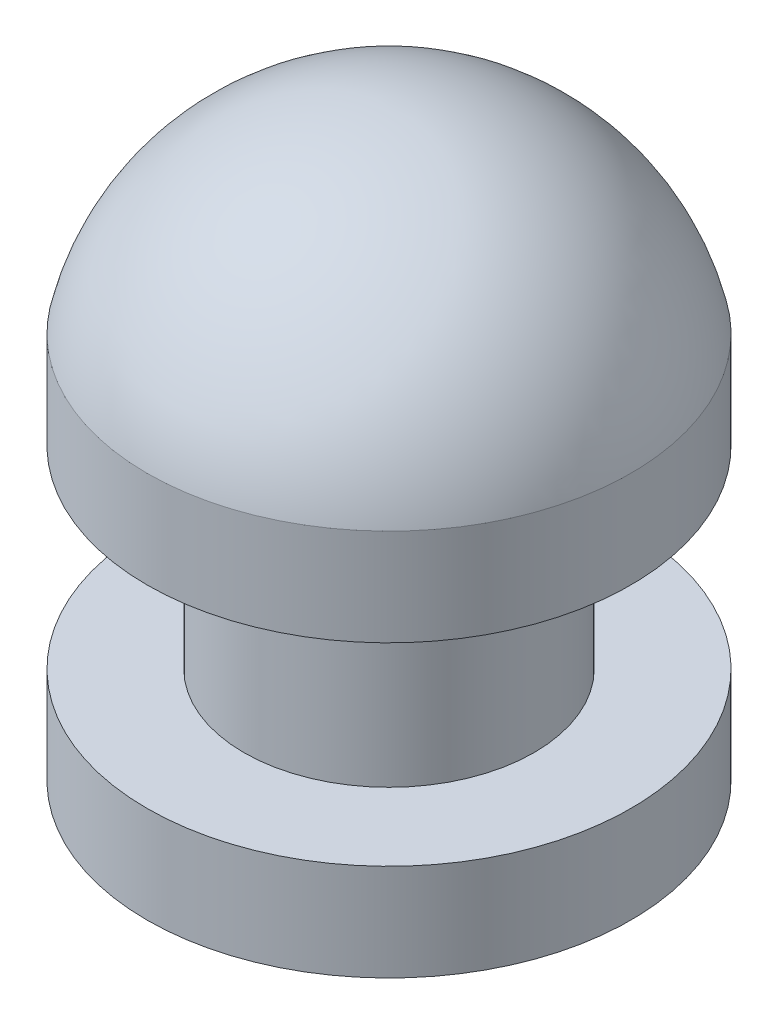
from build123d import *

# Parameters (mm, degrees)
DOME1_FACE_RADIUS = 12.5
DOME1_HEIGHT      = 10


with BuildPart() as part:
    # Sketch1 → Revolve1 (revolve)
    with BuildSketch(Plane.XY, mode=Mode.PRIVATE) as revolve1_sk:
        Polygon((0, 0), (-12.5, 0), (-12.5, 5), (-7.5, 5), (-7.5, 15), (-12.5, 15), (-12.5, 20), (0, 20), align=None)
    revolve(revolve1_sk.sketch.rotate(Axis((0, -48.088444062, 0), (0, 1, 0)), 270), axis=Axis((0, -48.088444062, 0), (0, 1, 0)))

    # Dome1: a dome of height H over a round flat face of radius A is a cap of a sphere of radius (A * A + H * H) / (2 * H)
    dome1_r = (DOME1_FACE_RADIUS * DOME1_FACE_RADIUS + DOME1_HEIGHT * DOME1_HEIGHT) / (2 * DOME1_HEIGHT)
    dome1_base = Plane((0, 20, 0), z_dir=(0, 1, 0))
    with Locations(dome1_base.offset(DOME1_HEIGHT - dome1_r)):
        dome1_ball = Sphere(dome1_r, mode=Mode.PRIVATE)
    add(split(dome1_ball, bisect_by=dome1_base, keep=Keep.TOP, mode=Mode.PRIVATE))


solid = part.part
